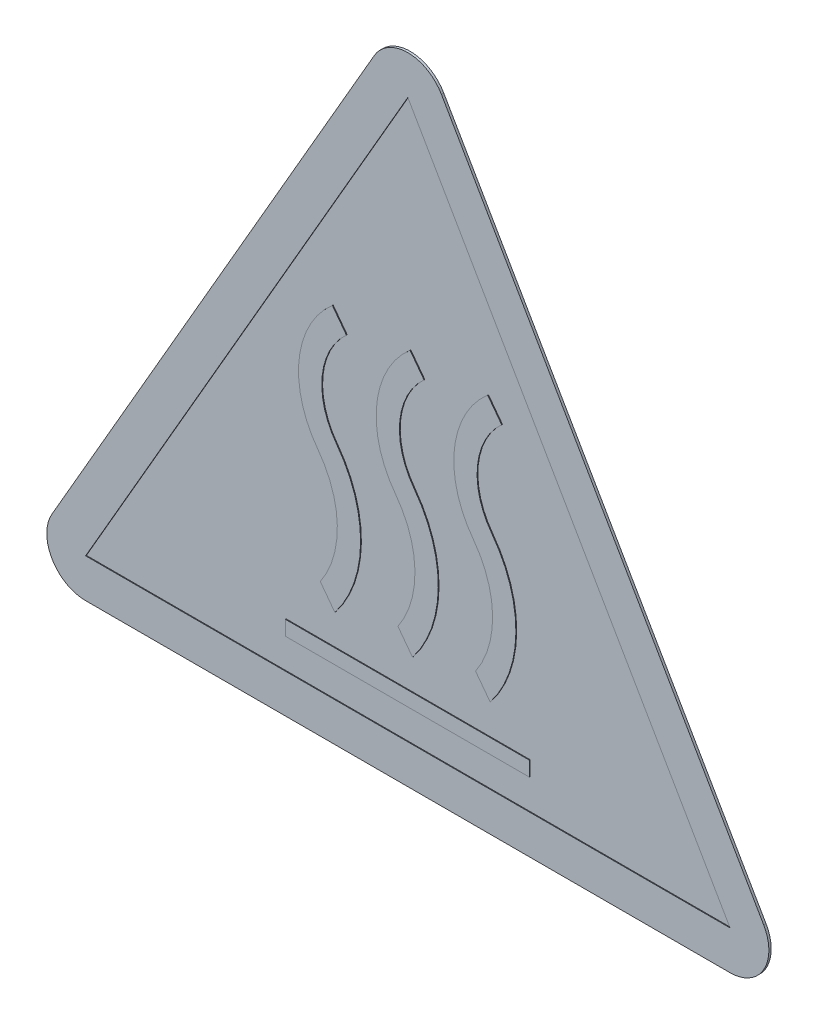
from build123d import *

# Parameters (mm, degrees)
EXTRUSION1_DEPTH        = 0.3
ESQUISSE2_W             = 31.433318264
ESQUISSE2_H             = 1.888220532
ENL_V_MAT_EXTRU_1_DEPTH = 0.1


with BuildPart() as part:
    # Esquisse1 → Extrusion1 (new body)
    with BuildSketch(Plane.XY):
        with BuildLine():
            Line((-41.5, 0), (41.5, 0))
            ThreePointArc((41.5, 0), (45.830127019, 2.5), (45.830127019, 7.5))
            Line((45.830127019, 7.5), (4.330127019, 79.380108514))
            ThreePointArc((4.330127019, 79.380108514), (0, 81.880108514), (-4.330127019, 79.380108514))
            Line((-4.330127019, 79.380108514), (-45.830127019, 7.5))
            ThreePointArc((-45.830127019, 7.5), (-45.830127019, 2.5), (-41.5, 0))
        make_face()
    extrude(amount=EXTRUSION1_DEPTH)

    # Esquisse2 → Enl_v. mat.-Extru.1 (cut)
    with BuildSketch(Plane.XY.offset(0.3)):
        Polygon((0, 76.880108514), (-41.5, 5), (41.5, 5), align=None)
        with BuildLine():
            Line((-1.276876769, 17.252528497), (0.602378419, 14.746854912))
            ThreePointArc((0.602378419, 14.746854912), (3.917892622, 24.151033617), (0.81891172, 33.628772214))
            ThreePointArc((0.81891172, 33.628772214), (-1.034676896, 40.266675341), (2.08705067, 46.410970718))
            Line((2.08705067, 46.410970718), (0.281980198, 48.817731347))
            ThreePointArc((0.281980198, 48.817731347), (-4.006596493, 40.691396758), (-1.58108828, 31.828772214))
            ThreePointArc((-1.58108828, 31.828772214), (0.916190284, 24.589594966), (-1.276876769, 17.252528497))
        make_face(mode=Mode.SUBTRACT)
        with BuildLine():
            Line((-11.276876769, 17.252528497), (-9.397621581, 14.746854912))
            ThreePointArc((-9.397621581, 14.746854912), (-6.082107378, 24.151033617), (-9.18108828, 33.628772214))
            ThreePointArc((-9.18108828, 33.628772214), (-11.034676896, 40.266675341), (-7.91294933, 46.410970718))
            Line((-7.91294933, 46.410970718), (-9.718019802, 48.817731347))
            ThreePointArc((-9.718019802, 48.817731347), (-14.006596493, 40.691396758), (-11.58108828, 31.828772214))
            ThreePointArc((-11.58108828, 31.828772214), (-9.083809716, 24.589594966), (-11.276876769, 17.252528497))
        make_face(mode=Mode.SUBTRACT)
        with Locations((-0.055535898, 9.839951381)):
            Rectangle(ESQUISSE2_W, ESQUISSE2_H, mode=Mode.SUBTRACT)
        with BuildLine():
            Line((8.723123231, 17.252528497), (10.602378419, 14.746854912))
            ThreePointArc((10.602378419, 14.746854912), (13.917892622, 24.151033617), (10.81891172, 33.628772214))
            ThreePointArc((10.81891172, 33.628772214), (8.965323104, 40.266675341), (12.08705067, 46.410970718))
            Line((12.08705067, 46.410970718), (10.281980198, 48.817731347))
            ThreePointArc((10.281980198, 48.817731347), (5.993403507, 40.691396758), (8.41891172, 31.828772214))
            ThreePointArc((8.41891172, 31.828772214), (10.916190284, 24.589594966), (8.723123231, 17.252528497))
        make_face(mode=Mode.SUBTRACT)
    extrude(amount=-ENL_V_MAT_EXTRU_1_DEPTH, mode=Mode.SUBTRACT)


solid = part.part
